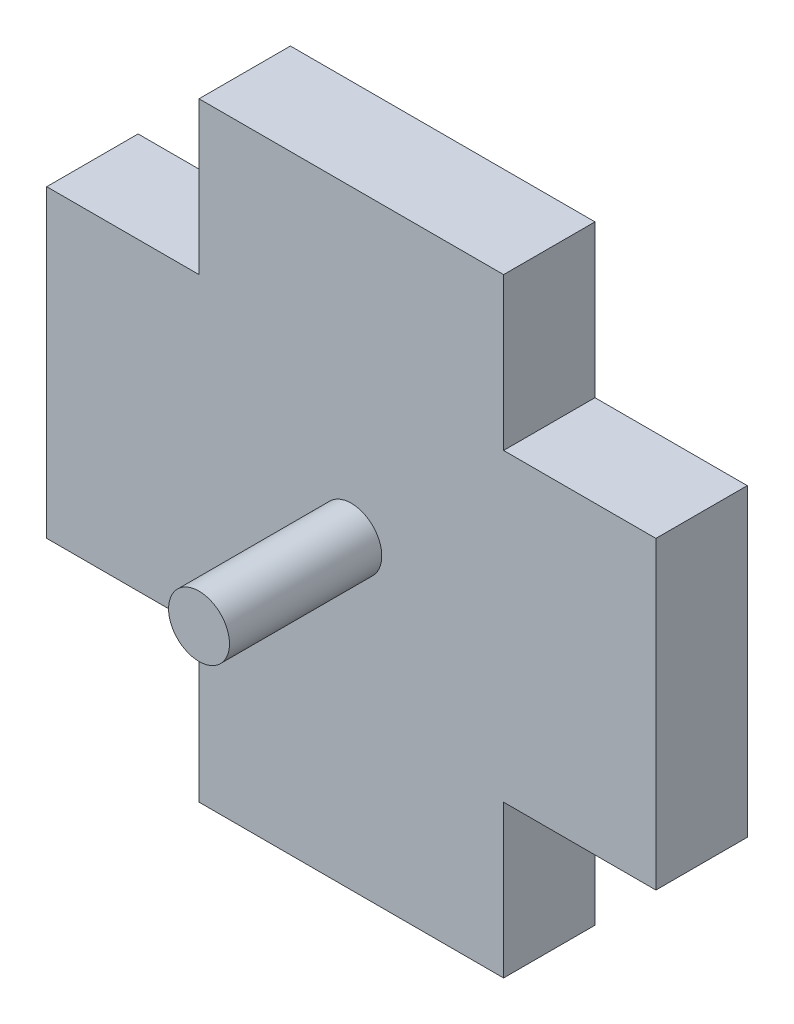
from build123d import *

# Parameters (mm, degrees)
EXTRUDE1_DEPTH = 3
SKETCH2_R      = 1
EXTRUDE2_DEPTH = 5


with BuildPart() as part:
    # Sketch1 → Extrude1 (new body)
    with BuildSketch(Plane.XY):
        Polygon((-10, 5), (-5, 5), (-5, 10), (5, 10), (5, 5), (10, 5), (10, -5), (5, -5), (5, -10), (-5, -10), (-5, -5), (-10, -5), align=None)
    extrude(amount=-EXTRUDE1_DEPTH)

    # Sketch2 → Extrude2 (add)
    with BuildSketch(Plane.XY):
        with Locations(Location((0, 0, 0), (0, 0, 180))):
            Circle(SKETCH2_R)
    extrude(amount=EXTRUDE2_DEPTH)


solid = part.part
